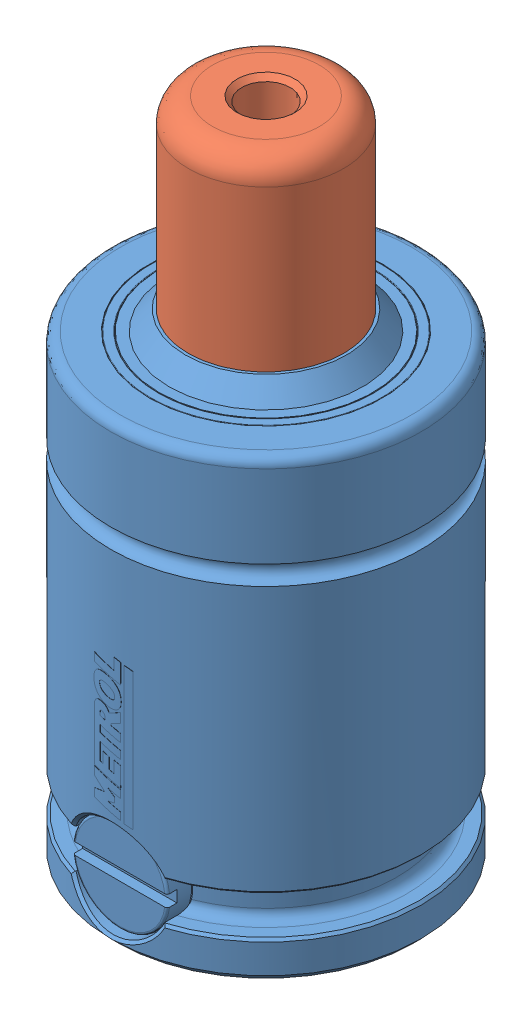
SolidWorks assembly EX0360-019.SLDASM, configuration Default (file format 7000). Lengths in mm.
Overall size (32 68 32.1).
2 component instances, 2 part files, 4 mates.
Components (placement in the parent):
- EX0360 Body-1: EX0360 Body.SLDPRT [EX-360-019] at (0 0 14.6541) x (0 0 1) z (0 -1 0) size (32.1 32 49)
- EX-360 Piston-1: EX-360 Piston.SLDPRT [EX-360-019] at (0 32 14.6541) x (-0.339228 0 0.940704) z (0 -1 0) size (24 24 36)
Mates (geometry in assembly coordinates):
- Concentric1: concentric aligned: cylinder of EX0360 Body-1 through (0 0 14.6541) axis (0 -1 0) radius 8; cylinder of EX-360 Piston-1 through (0 32 14.6541) axis (0 -1 0) radius 8
- LimitDistance1: limit distance anti-aligned: plane of EX0360 Body-1 through (0 37 14.6541) normal (0 -1 0); plane of EX-360 Piston-1 through (-11.2885 37 10.5833) normal (0 1 0)
- Coincident1: coincident anti-aligned: plane of EX0360 Body-1 through (0 0 14.6541) normal (0 -1 0); plane of assembly through (0 0 0) normal (0 1 0)
- Coincident2: coincident anti-aligned: plane of EX0360 Body-1; plane of assembly through (0 0 0) normal (1 0 0)
